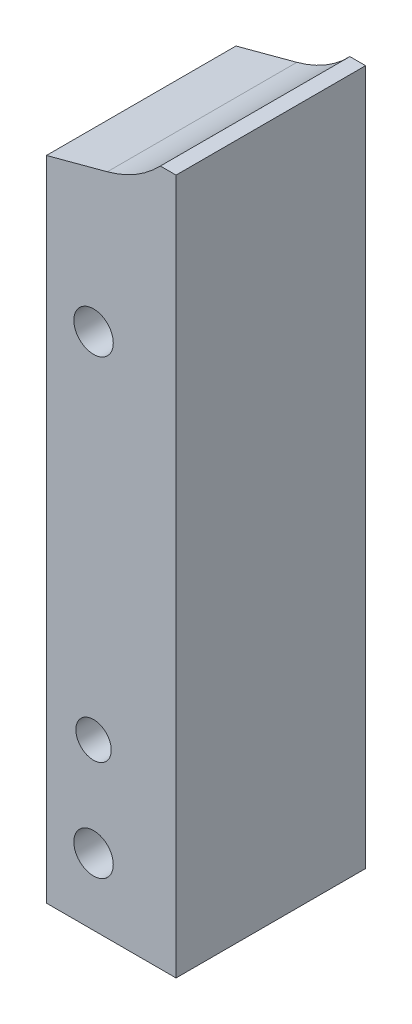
from build123d import *

# Parameters (mm, degrees)
BASE_EXTRUSION_DEPTH      = 24.125
BASE_EXTRUSION_DEPTH_BACK = 24.125
ESQUISSE1_R               = 5.02
ESQUISSE1_R_2             = 4.5


with BuildPart() as part:
    # Esquisse1 → Base-Extrusion (new, two sides: drawn at the far end of the back side and taken through both)
    with BuildSketch(Plane.XY.offset(-BASE_EXTRUSION_DEPTH_BACK)):
        with BuildLine():
            Line((25, -20), (21, -20))
            ThreePointArc((21, -20), (14.805131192, -24.936080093), (7.505752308, -28.011848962))
            Line((7.505752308, -28.011848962), (-8, -32.166602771))
            Line((-8, -32.166602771), (-8, -197))
            Line((-8, -197), (25, -197))
            Line((25, -197), (25, -20))
        make_face()
        with Locations((4, -180)):
            Circle(ESQUISSE1_R, mode=Mode.SUBTRACT)
        with Locations((4, -155)):
            Circle(ESQUISSE1_R_2, mode=Mode.SUBTRACT)
        with Locations((4, -65)):
            Circle(ESQUISSE1_R, mode=Mode.SUBTRACT)
    extrude(amount=BASE_EXTRUSION_DEPTH + BASE_EXTRUSION_DEPTH_BACK)


solid = part.part
